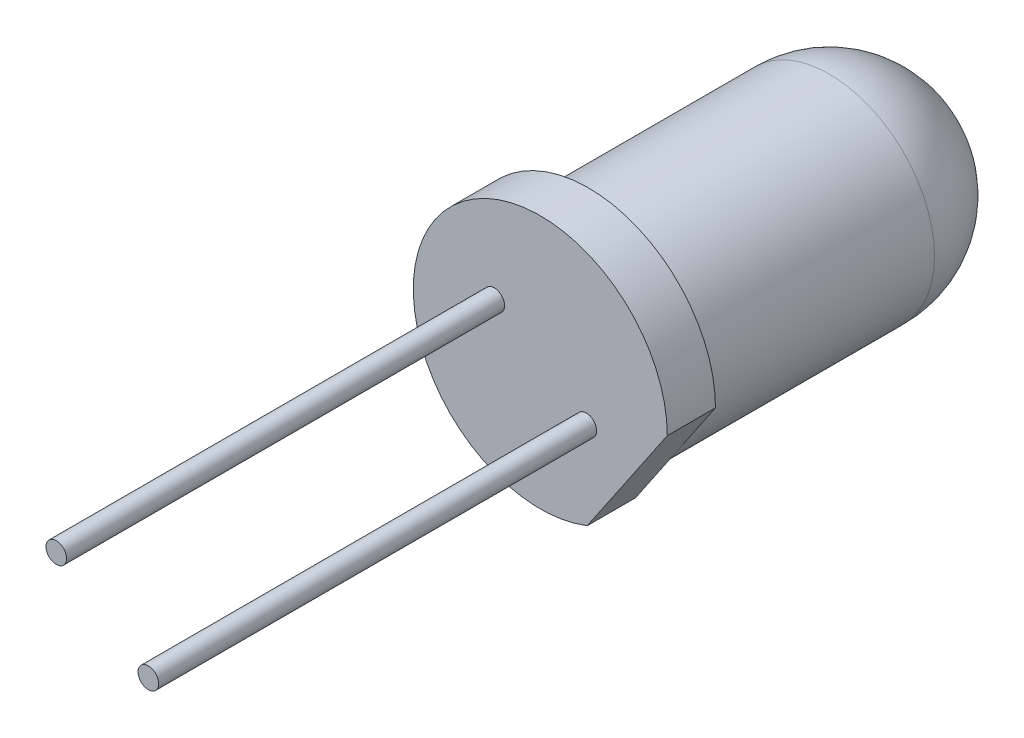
from build123d import *

# Parameters (mm, degrees)
ESQUISSE1_R             = 2.9
BASE_EXTRUSION_DEPTH    = 1.1
ESQUISSE2_R             = 2.4
BOSS_EXTRU_1_DEPTH      = 7.9
CONG_1_R                = 2.4
ENL_V_MAT_EXTRU_1_DEPTH = 20.88039235
ESQUISSE4_R             = 0.235341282
BOSS_EXTRU_2_DEPTH      = 10


with BuildPart() as part:
    # Esquisse1 → Base-Extrusion (new body)
    with BuildSketch(Plane.XY):
        with Locations((10, 10)):
            Circle(ESQUISSE1_R)
    extrude(amount=BASE_EXTRUSION_DEPTH)

    # Esquisse2 → Boss.-Extru.1 (add)
    with BuildSketch(Plane(origin=(0, 0, 0), x_dir=(-1, 0, 0), z_dir=(0, 0, -1))):
        with Locations(Location((-10, 10, 0), (0, 0, 180))):
            Circle(ESQUISSE2_R)
    extrude(amount=BOSS_EXTRU_1_DEPTH)

    # Cong_1
    cong_1_edges = [part.edges().sort_by_distance(p)[0] for p in [
        (7.6, 10, -7.9),
    ]]
    fillet(cong_1_edges, radius=CONG_1_R)

    # Esquisse3 → Enl_v. mat.-Extru.1 (cut, through all)
    with BuildSketch(Plane(origin=(0, 0, 0), x_dir=(-1, 0, 0), z_dir=(0, 0, -1))):
        Polygon((-26.216430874, 29.632524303), (-12.9, 10), (-11.072413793, 7.305574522), (2.244017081, -12.326949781), (-37.021031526, -38.95981153), (-65.481479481, 2.999662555), align=None)
    extrude(amount=-ENL_V_MAT_EXTRU_1_DEPTH, mode=Mode.SUBTRACT)

    # Esquisse4 → Boss.-Extru.2 (add)
    with BuildSketch(Plane.XY.offset(1.1)):
        with Locations((8.948965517, 10.712900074)):
            Circle(ESQUISSE4_R)
        with Locations((11.051034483, 9.287099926)):
            Circle(ESQUISSE4_R)
    extrude(amount=BOSS_EXTRU_2_DEPTH)


solid = part.part
